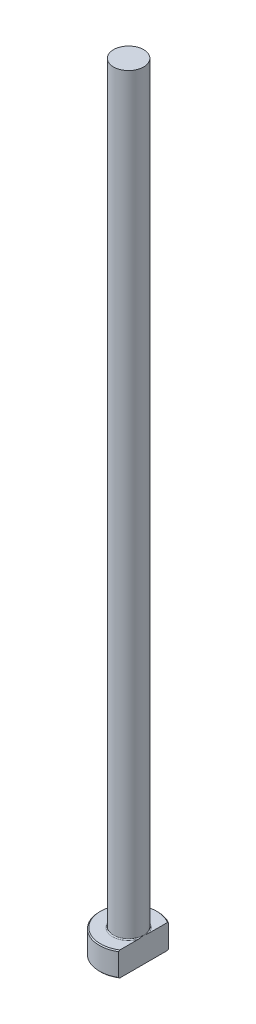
from build123d import *
from build123d.topology import SkipClean

# Parameters (mm, degrees)
CHAMFER1_SIZE = 0.2
FILLET1_R     = 0.2
KEY_DEPTH     = 161.224842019


with BuildPart() as part:
    # Sketch1 → Revolve1 (revolve)
    with BuildSketch(Plane.XY, mode=Mode.PRIVATE) as revolve1_sk:
        Polygon((0, 0), (-6, 0), (-6, 5), (-3.1, 5), (-3.1, 160), (0, 160), align=None)
    revolve(revolve1_sk.sketch.rotate(Axis((0, 259.958771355, 0), (0, -1, 0)), 270), axis=Axis((0, 259.958771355, 0), (0, -1, 0)))

    # Chamfer1
    chamfer1_edges = [part.edges().sort_by_distance(p)[0] for p in [
        (0, 5, -6),
        (0, 0, -6),
    ]]
    chamfer(chamfer1_edges, length=CHAMFER1_SIZE)

    # Fillet1
    fillet1_edges = [part.edges().sort_by_distance(p)[0] for p in [
        (0, 5, -3.1),
    ]]
    fillet(fillet1_edges, radius=FILLET1_R)

    # Sketch2 → KEY (cut, through all)
    with SkipClean():  # the faces are left unmerged after this step: merging them gives an invalid solid
        with BuildSketch(Plane(origin=(0, 0, 0), x_dir=(1, 0, 0), z_dir=(0, 1, 0))):
            with BuildLine():
                Line((3.1, 5.137119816), (3.1, -5.137119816))
                ThreePointArc((3.1, -5.137119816), (6, 0), (3.1, 5.137119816))
            make_face()
        extrude(amount=KEY_DEPTH, mode=Mode.SUBTRACT)


solid = part.part
